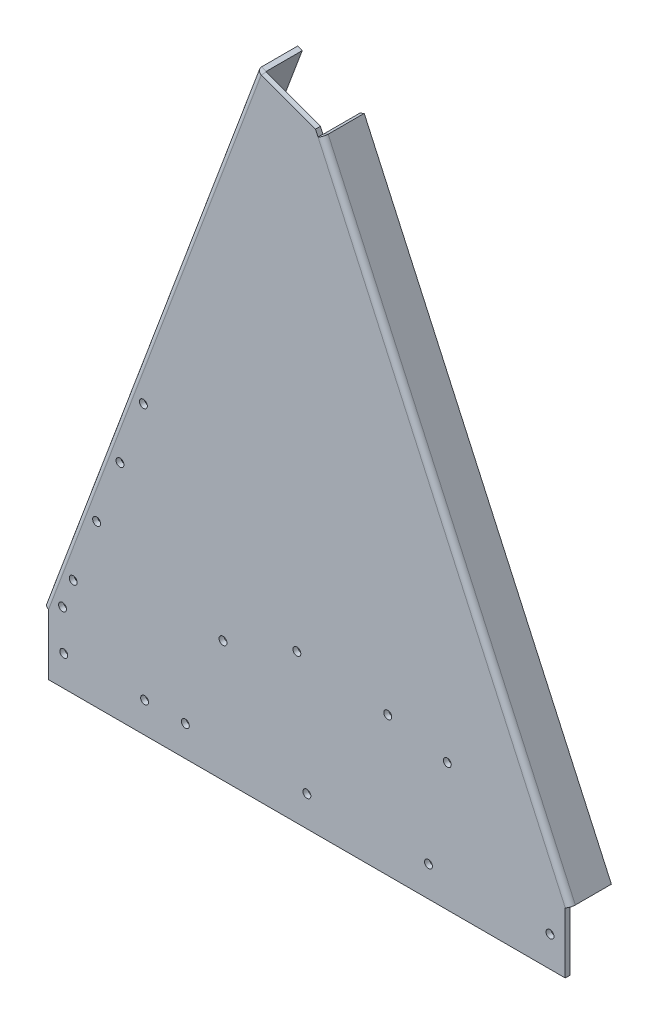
ISO-10303-21;
HEADER;
FILE_DESCRIPTION(('STEP AP214'),'2;1');
FILE_NAME('part.step','',(''),(''),'','','');
FILE_SCHEMA(('AUTOMOTIVE_DESIGN { 1 0 10303 214 1 1 1 1 }'));
ENDSEC;
DATA;
#1=APPLICATION_CONTEXT('core data for automotive mechanical design processes');
#2=APPLICATION_PROTOCOL_DEFINITION('international standard','automotive_design',2000,#1);
#3=PRODUCT_CONTEXT('',#1,'mechanical');
#4=PRODUCT('Part','Part','',(#3));
#5=PRODUCT_RELATED_PRODUCT_CATEGORY('part','',(#4));
#6=PRODUCT_DEFINITION_FORMATION('','',#4);
#7=PRODUCT_DEFINITION_CONTEXT('part definition',#1,'design');
#8=PRODUCT_DEFINITION('design','',#6,#7);
#9=PRODUCT_DEFINITION_SHAPE('','',#8);
#10=(LENGTH_UNIT() NAMED_UNIT(*) SI_UNIT(.MILLI.,.METRE.));
#11=(NAMED_UNIT(*) PLANE_ANGLE_UNIT() SI_UNIT($,.RADIAN.));
#12=(NAMED_UNIT(*) SI_UNIT($,.STERADIAN.) SOLID_ANGLE_UNIT());
#13=UNCERTAINTY_MEASURE_WITH_UNIT(LENGTH_MEASURE(1.E-05),#10,'distance_accuracy_value','');
#14=(GEOMETRIC_REPRESENTATION_CONTEXT(3) GLOBAL_UNCERTAINTY_ASSIGNED_CONTEXT((#13)) GLOBAL_UNIT_ASSIGNED_CONTEXT((#10,
#11,#12)) REPRESENTATION_CONTEXT('',''));
#15=CARTESIAN_POINT('',(0.,0.,0.));
#16=DIRECTION('',(0.,0.,1.));
#17=DIRECTION('',(1.,0.,0.));
#18=AXIS2_PLACEMENT_3D('',#15,#16,#17);
#19=CARTESIAN_POINT('',(425.,100.,8.));
#20=DIRECTION('',(-0.91041077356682,-0.413705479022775,0.));
#21=DIRECTION('',(0.413705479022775,-0.91041077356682,0.));
#22=AXIS2_PLACEMENT_3D('',#19,#20,#21);
#23=PLANE('',#22);
#24=DIRECTION('',(-6.17962856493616E-12,-2.86373031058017E-12,1.));
#25=VECTOR('',#24,1.);
#26=CARTESIAN_POINT('',(18.3275141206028,994.93379041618,5.23875647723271E-12));
#27=LINE('',#26,#25);
#28=CARTESIAN_POINT('',(18.3275141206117,994.933790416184,0.));
#29=VERTEX_POINT('',#28);
#30=CARTESIAN_POINT('',(18.3275141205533,994.933790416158,8.00000000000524));
#31=VERTEX_POINT('',#30);
#32=EDGE_CURVE('E100',#29,#31,#27,.T.);
#33=ORIENTED_EDGE('',*,*,#32,.F.);
#34=DIRECTION('',(-0.413705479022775,0.91041077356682,0.));
#35=VECTOR('',#34,1.);
#36=CARTESIAN_POINT('',(425.,100.,0.));
#37=LINE('',#36,#35);
#38=CARTESIAN_POINT('',(14.1904593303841,1004.03789815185,0.));
#39=VERTEX_POINT('',#38);
#40=EDGE_CURVE('E421',#29,#39,#37,.T.);
#41=ORIENTED_EDGE('',*,*,#40,.T.);
#42=DIRECTION('',(0.,0.,-1.));
#43=VECTOR('',#42,1.);
#44=CARTESIAN_POINT('',(14.1904593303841,1004.03789815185,8.));
#45=LINE('',#44,#43);
#46=CARTESIAN_POINT('',(14.1904593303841,1004.03789815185,8.));
#47=VERTEX_POINT('',#46);
#48=EDGE_CURVE('E449',#47,#39,#45,.T.);
#49=ORIENTED_EDGE('',*,*,#48,.F.);
#50=DIRECTION('',(-0.413705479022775,0.91041077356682,0.));
#51=VECTOR('',#50,1.);
#52=CARTESIAN_POINT('',(425.,100.,8.));
#53=LINE('',#52,#51);
#54=EDGE_CURVE('E432',#31,#47,#53,.T.);
#55=ORIENTED_EDGE('',*,*,#54,.F.);
#56=EDGE_LOOP('',(#33,#41,#49,#55));
#57=FACE_BOUND('',#56,.T.);
#58=ADVANCED_FACE('F83',(#57),#23,.F.);
#59=CARTESIAN_POINT('',(-425.,100.,8.));
#60=DIRECTION('',(1.,0.,0.));
#61=DIRECTION('',(0.,1.,0.));
#62=AXIS2_PLACEMENT_3D('',#59,#60,#61);
#63=PLANE('',#62);
#64=DIRECTION('',(0.,-1.,0.));
#65=VECTOR('',#64,1.);
#66=CARTESIAN_POINT('',(-425.,100.,0.));
#67=LINE('',#66,#65);
#68=CARTESIAN_POINT('',(-425.00000000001,100.000000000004,-5.2804982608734E-12));
#69=VERTEX_POINT('',#68);
#70=CARTESIAN_POINT('',(-425.,0.,0.));
#71=VERTEX_POINT('',#70);
#72=EDGE_CURVE('E414',#69,#71,#67,.T.);
#73=ORIENTED_EDGE('',*,*,#72,.T.);
#74=DIRECTION('',(0.,0.,-1.));
#75=VECTOR('',#74,1.);
#76=CARTESIAN_POINT('',(-425.,0.,8.));
#77=LINE('',#76,#75);
#78=CARTESIAN_POINT('',(-425.,0.,8.));
#79=VERTEX_POINT('',#78);
#80=EDGE_CURVE('E13',#79,#71,#77,.T.);
#81=ORIENTED_EDGE('',*,*,#80,.F.);
#82=DIRECTION('',(0.,-1.,0.));
#83=VECTOR('',#82,1.);
#84=CARTESIAN_POINT('',(-425.,100.,8.));
#85=LINE('',#84,#83);
#86=CARTESIAN_POINT('',(-425.,100.,8.));
#87=VERTEX_POINT('',#86);
#88=EDGE_CURVE('E460',#87,#79,#85,.T.);
#89=ORIENTED_EDGE('',*,*,#88,.F.);
#90=DIRECTION('',(0.,0.,-1.));
#91=VECTOR('',#90,1.);
#92=CARTESIAN_POINT('',(-425.,100.,8.));
#93=LINE('',#92,#91);
#94=EDGE_CURVE('E444',#87,#69,#93,.T.);
#95=ORIENTED_EDGE('',*,*,#94,.T.);
#96=EDGE_LOOP('',(#73,#81,#89,#95));
#97=FACE_BOUND('',#96,.T.);
#98=ADVANCED_FACE('F85',(#97),#63,.F.);
#99=CARTESIAN_POINT('',(-425.,0.,8.));
#100=DIRECTION('',(0.,1.,0.));
#101=DIRECTION('',(-1.,0.,0.));
#102=AXIS2_PLACEMENT_3D('',#99,#100,#101);
#103=PLANE('',#102);
#104=DIRECTION('',(1.,0.,0.));
#105=VECTOR('',#104,1.);
#106=CARTESIAN_POINT('',(-425.,0.,0.));
#107=LINE('',#106,#105);
#108=CARTESIAN_POINT('',(425.,0.,0.));
#109=VERTEX_POINT('',#108);
#110=EDGE_CURVE('E405',#71,#109,#107,.T.);
#111=ORIENTED_EDGE('',*,*,#110,.T.);
#112=DIRECTION('',(0.,0.,-1.));
#113=VECTOR('',#112,1.);
#114=CARTESIAN_POINT('',(425.,0.,8.));
#115=LINE('',#114,#113);
#116=CARTESIAN_POINT('',(425.,0.,8.));
#117=VERTEX_POINT('',#116);
#118=EDGE_CURVE('E92',#117,#109,#115,.T.);
#119=ORIENTED_EDGE('',*,*,#118,.F.);
#120=DIRECTION('',(1.,0.,0.));
#121=VECTOR('',#120,1.);
#122=CARTESIAN_POINT('',(-425.,0.,8.));
#123=LINE('',#122,#121);
#124=EDGE_CURVE('E466',#79,#117,#123,.T.);
#125=ORIENTED_EDGE('',*,*,#124,.F.);
#126=ORIENTED_EDGE('',*,*,#80,.T.);
#127=EDGE_LOOP('',(#111,#119,#125,#126));
#128=FACE_BOUND('',#127,.T.);
#129=ADVANCED_FACE('F392',(#128),#103,.F.);
#130=CARTESIAN_POINT('',(425.,0.,8.));
#131=DIRECTION('',(-1.,0.,0.));
#132=DIRECTION('',(0.,0.,1.));
#133=AXIS2_PLACEMENT_3D('',#130,#131,#132);
#134=PLANE('',#133);
#135=DIRECTION('',(0.,1.,0.));
#136=VECTOR('',#135,1.);
#137=CARTESIAN_POINT('',(425.,0.,0.));
#138=LINE('',#137,#136);
#139=CARTESIAN_POINT('',(425.,100.,0.));
#140=VERTEX_POINT('',#139);
#141=EDGE_CURVE('E413',#109,#140,#138,.T.);
#142=ORIENTED_EDGE('',*,*,#141,.T.);
#143=DIRECTION('',(0.,0.,-1.));
#144=VECTOR('',#143,1.);
#145=CARTESIAN_POINT('',(425.,100.,8.));
#146=LINE('',#145,#144);
#147=CARTESIAN_POINT('',(425.,100.,8.));
#148=VERTEX_POINT('',#147);
#149=EDGE_CURVE('E418',#148,#140,#146,.T.);
#150=ORIENTED_EDGE('',*,*,#149,.F.);
#151=DIRECTION('',(0.,1.,0.));
#152=VECTOR('',#151,1.);
#153=CARTESIAN_POINT('',(425.,0.,8.));
#154=LINE('',#153,#152);
#155=EDGE_CURVE('E417',#117,#148,#154,.T.);
#156=ORIENTED_EDGE('',*,*,#155,.F.);
#157=ORIENTED_EDGE('',*,*,#118,.T.);
#158=EDGE_LOOP('',(#142,#150,#156,#157));
#159=FACE_BOUND('',#158,.T.);
#160=ADVANCED_FACE('F398',(#159),#134,.F.);
#161=CARTESIAN_POINT('',(14.1904593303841,1004.03789815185,8.));
#162=DIRECTION('',(-0.344334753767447,-0.938846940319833,0.));
#163=DIRECTION('',(0.938846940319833,-0.344334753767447,0.));
#164=AXIS2_PLACEMENT_3D('',#161,#162,#163);
#165=PLANE('',#164);
#166=DIRECTION('',(-0.938846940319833,0.344334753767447,0.));
#167=VECTOR('',#166,1.);
#168=CARTESIAN_POINT('',(14.1904593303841,1004.03789815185,0.));
#169=LINE('',#168,#167);
#170=CARTESIAN_POINT('',(-75.0000000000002,1036.74969975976,-5.2804982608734E-12));
#171=VERTEX_POINT('',#170);
#172=EDGE_CURVE('E428',#39,#171,#169,.T.);
#173=ORIENTED_EDGE('',*,*,#172,.T.);
#174=DIRECTION('',(0.,0.,-1.));
#175=VECTOR('',#174,1.);
#176=CARTESIAN_POINT('',(-75.0000000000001,1036.74969975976,8.));
#177=LINE('',#176,#175);
#178=CARTESIAN_POINT('',(-75.0000000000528,1036.74969975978,7.99999999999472));
#179=VERTEX_POINT('',#178);
#180=EDGE_CURVE('E447',#179,#171,#177,.T.);
#181=ORIENTED_EDGE('',*,*,#180,.F.);
#182=DIRECTION('',(-0.938846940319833,0.344334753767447,0.));
#183=VECTOR('',#182,1.);
#184=CARTESIAN_POINT('',(14.1904593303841,1004.03789815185,8.));
#185=LINE('',#184,#183);
#186=EDGE_CURVE('E437',#47,#179,#185,.T.);
#187=ORIENTED_EDGE('',*,*,#186,.F.);
#188=ORIENTED_EDGE('',*,*,#48,.T.);
#189=EDGE_LOOP('',(#173,#181,#187,#188));
#190=FACE_BOUND('',#189,.T.);
#191=ADVANCED_FACE('F396',(#190),#165,.F.);
#192=CARTESIAN_POINT('',(-425.,0.,8.));
#193=DIRECTION('',(0.,0.,1.));
#194=DIRECTION('',(1.,0.,0.));
#195=AXIS2_PLACEMENT_3D('',#192,#193,#194);
#196=PLANE('',#195);
#197=CARTESIAN_POINT('',(-401.973272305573,115.162515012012,8.));
#198=DIRECTION('',(0.,0.,1.));
#199=DIRECTION('',(1.,0.,0.));
#200=AXIS2_PLACEMENT_3D('',#197,#198,#199);
#201=CIRCLE('',#200,6.50000000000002);
#202=CARTESIAN_POINT('',(-395.473272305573,115.162515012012,8.));
#203=VERTEX_POINT('',#202);
#204=EDGE_CURVE('E326',#203,#203,#201,.T.);
#205=ORIENTED_EDGE('',*,*,#204,.F.);
#206=EDGE_LOOP('',(#205));
#207=FACE_BOUND('',#206,.T.);
#208=CARTESIAN_POINT('',(231.,210.,8.));
#209=DIRECTION('',(0.,0.,1.));
#210=DIRECTION('',(1.,0.,0.));
#211=AXIS2_PLACEMENT_3D('',#208,#209,#210);
#212=CIRCLE('',#211,6.50000000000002);
#213=CARTESIAN_POINT('',(237.5,210.,8.));
#214=VERTEX_POINT('',#213);
#215=EDGE_CURVE('E316',#214,#214,#212,.T.);
#216=ORIENTED_EDGE('',*,*,#215,.F.);
#217=EDGE_LOOP('',(#216));
#218=FACE_BOUND('',#217,.T.);
#219=CARTESIAN_POINT('',(133.,229.,8.));
#220=DIRECTION('',(0.,0.,1.));
#221=DIRECTION('',(1.,0.,0.));
#222=AXIS2_PLACEMENT_3D('',#219,#220,#221);
#223=CIRCLE('',#222,6.50000000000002);
#224=CARTESIAN_POINT('',(139.5,229.,8.));
#225=VERTEX_POINT('',#224);
#226=EDGE_CURVE('E313',#225,#225,#223,.T.);
#227=ORIENTED_EDGE('',*,*,#226,.F.);
#228=EDGE_LOOP('',(#227));
#229=FACE_BOUND('',#228,.T.);
#230=CARTESIAN_POINT('',(-16.4999999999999,244.5,8.));
#231=DIRECTION('',(0.,0.,1.));
#232=DIRECTION('',(1.,0.,0.));
#233=AXIS2_PLACEMENT_3D('',#230,#231,#232);
#234=CIRCLE('',#233,6.50000000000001);
#235=CARTESIAN_POINT('',(-9.99999999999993,244.5,8.));
#236=VERTEX_POINT('',#235);
#237=EDGE_CURVE('E310',#236,#236,#234,.T.);
#238=ORIENTED_EDGE('',*,*,#237,.F.);
#239=EDGE_LOOP('',(#238));
#240=FACE_BOUND('',#239,.T.);
#241=CARTESIAN_POINT('',(-138.,199.,8.));
#242=DIRECTION('',(0.,0.,1.));
#243=DIRECTION('',(1.,0.,0.));
#244=AXIS2_PLACEMENT_3D('',#241,#242,#243);
#245=CIRCLE('',#244,6.50000000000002);
#246=CARTESIAN_POINT('',(-131.5,199.,8.));
#247=VERTEX_POINT('',#246);
#248=EDGE_CURVE('E306',#247,#247,#245,.T.);
#249=ORIENTED_EDGE('',*,*,#248,.F.);
#250=EDGE_LOOP('',(#249));
#251=FACE_BOUND('',#250,.T.);
#252=CARTESIAN_POINT('',(-268.973272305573,471.127400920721,8.));
#253=DIRECTION('',(0.,0.,1.));
#254=DIRECTION('',(1.,0.,0.));
#255=AXIS2_PLACEMENT_3D('',#252,#253,#254);
#256=CIRCLE('',#255,6.50000000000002);
#257=CARTESIAN_POINT('',(-262.473272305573,471.127400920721,8.));
#258=VERTEX_POINT('',#257);
#259=EDGE_CURVE('E302',#258,#258,#256,.T.);
#260=ORIENTED_EDGE('',*,*,#259,.F.);
#261=EDGE_LOOP('',(#260));
#262=FACE_BOUND('',#261,.T.);
#263=CARTESIAN_POINT('',(-307.473272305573,368.084933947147,8.));
#264=DIRECTION('',(0.,0.,1.));
#265=DIRECTION('',(1.,0.,0.));
#266=AXIS2_PLACEMENT_3D('',#263,#264,#265);
#267=CIRCLE('',#266,6.50000000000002);
#268=CARTESIAN_POINT('',(-300.973272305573,368.084933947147,8.));
#269=VERTEX_POINT('',#268);
#270=EDGE_CURVE('E298',#269,#269,#267,.T.);
#271=ORIENTED_EDGE('',*,*,#270,.F.);
#272=EDGE_LOOP('',(#271));
#273=FACE_BOUND('',#272,.T.);
#274=CARTESIAN_POINT('',(-345.973272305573,265.042466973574,8.));
#275=DIRECTION('',(0.,0.,1.));
#276=DIRECTION('',(1.,0.,0.));
#277=AXIS2_PLACEMENT_3D('',#274,#275,#276);
#278=CIRCLE('',#277,6.50000000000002);
#279=CARTESIAN_POINT('',(-339.473272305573,265.042466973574,8.));
#280=VERTEX_POINT('',#279);
#281=EDGE_CURVE('E294',#280,#280,#278,.T.);
#282=ORIENTED_EDGE('',*,*,#281,.F.);
#283=EDGE_LOOP('',(#282));
#284=FACE_BOUND('',#283,.T.);
#285=CARTESIAN_POINT('',(-384.473272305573,162.,8.));
#286=DIRECTION('',(0.,0.,1.));
#287=DIRECTION('',(1.,0.,0.));
#288=AXIS2_PLACEMENT_3D('',#285,#286,#287);
#289=CIRCLE('',#288,6.50000000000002);
#290=CARTESIAN_POINT('',(-377.973272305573,162.,8.));
#291=VERTEX_POINT('',#290);
#292=EDGE_CURVE('E290',#291,#291,#289,.T.);
#293=ORIENTED_EDGE('',*,*,#292,.F.);
#294=EDGE_LOOP('',(#293));
#295=FACE_BOUND('',#294,.T.);
#296=CARTESIAN_POINT('',(400.,50.,8.));
#297=DIRECTION('',(0.,0.,1.));
#298=DIRECTION('',(1.,0.,0.));
#299=AXIS2_PLACEMENT_3D('',#296,#297,#298);
#300=CIRCLE('',#299,6.50000000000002);
#301=CARTESIAN_POINT('',(406.5,50.,8.));
#302=VERTEX_POINT('',#301);
#303=EDGE_CURVE('E286',#302,#302,#300,.T.);
#304=ORIENTED_EDGE('',*,*,#303,.F.);
#305=EDGE_LOOP('',(#304));
#306=FACE_BOUND('',#305,.T.);
#307=CARTESIAN_POINT('',(-267.,50.,8.));
#308=DIRECTION('',(0.,0.,1.));
#309=DIRECTION('',(1.,0.,0.));
#310=AXIS2_PLACEMENT_3D('',#307,#308,#309);
#311=CIRCLE('',#310,6.50000000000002);
#312=CARTESIAN_POINT('',(-260.5,50.,8.));
#313=VERTEX_POINT('',#312);
#314=EDGE_CURVE('E282',#313,#313,#311,.T.);
#315=ORIENTED_EDGE('',*,*,#314,.F.);
#316=EDGE_LOOP('',(#315));
#317=FACE_BOUND('',#316,.T.);
#318=CARTESIAN_POINT('',(200.,50.,8.));
#319=DIRECTION('',(0.,0.,1.));
#320=DIRECTION('',(1.,0.,0.));
#321=AXIS2_PLACEMENT_3D('',#318,#319,#320);
#322=CIRCLE('',#321,6.50000000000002);
#323=CARTESIAN_POINT('',(206.5,50.,8.));
#324=VERTEX_POINT('',#323);
#325=EDGE_CURVE('E278',#324,#324,#322,.T.);
#326=ORIENTED_EDGE('',*,*,#325,.F.);
#327=EDGE_LOOP('',(#326));
#328=FACE_BOUND('',#327,.T.);
#329=CARTESIAN_POINT('',(0.,50.,8.));
#330=DIRECTION('',(0.,0.,1.));
#331=DIRECTION('',(1.,0.,0.));
#332=AXIS2_PLACEMENT_3D('',#329,#330,#331);
#333=CIRCLE('',#332,6.5);
#334=CARTESIAN_POINT('',(6.5,50.,8.));
#335=VERTEX_POINT('',#334);
#336=EDGE_CURVE('E274',#335,#335,#333,.T.);
#337=ORIENTED_EDGE('',*,*,#336,.F.);
#338=EDGE_LOOP('',(#337));
#339=FACE_BOUND('',#338,.T.);
#340=CARTESIAN_POINT('',(-200.,50.,8.));
#341=DIRECTION('',(0.,0.,1.));
#342=DIRECTION('',(1.,0.,0.));
#343=AXIS2_PLACEMENT_3D('',#340,#341,#342);
#344=CIRCLE('',#343,6.50000000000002);
#345=CARTESIAN_POINT('',(-193.5,50.,8.));
#346=VERTEX_POINT('',#345);
#347=EDGE_CURVE('E270',#346,#346,#344,.T.);
#348=ORIENTED_EDGE('',*,*,#347,.F.);
#349=EDGE_LOOP('',(#348));
#350=FACE_BOUND('',#349,.T.);
#351=CARTESIAN_POINT('',(-400.,50.,8.));
#352=DIRECTION('',(0.,0.,1.));
#353=DIRECTION('',(1.,0.,0.));
#354=AXIS2_PLACEMENT_3D('',#351,#352,#353);
#355=CIRCLE('',#354,6.50000000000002);
#356=CARTESIAN_POINT('',(-393.5,50.,8.));
#357=VERTEX_POINT('',#356);
#358=EDGE_CURVE('E266',#357,#357,#355,.T.);
#359=ORIENTED_EDGE('',*,*,#358,.F.);
#360=EDGE_LOOP('',(#359));
#361=FACE_BOUND('',#360,.T.);
#362=ORIENTED_EDGE('',*,*,#88,.T.);
#363=ORIENTED_EDGE('',*,*,#124,.T.);
#364=ORIENTED_EDGE('',*,*,#155,.T.);
#365=EDGE_CURVE('E200',#148,#31,#53,.T.);
#366=ORIENTED_EDGE('',*,*,#365,.T.);
#367=ORIENTED_EDGE('',*,*,#54,.T.);
#368=ORIENTED_EDGE('',*,*,#186,.T.);
#369=DIRECTION('',(-0.35,-0.93674969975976,0.));
#370=VECTOR('',#369,1.);
#371=CARTESIAN_POINT('',(-75.0000000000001,1036.74969975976,8.));
#372=LINE('',#371,#370);
#373=EDGE_CURVE('E441',#179,#87,#372,.T.);
#374=ORIENTED_EDGE('',*,*,#373,.T.);
#375=EDGE_LOOP('',(#362,#363,#364,#366,#367,#368,#374));
#376=FACE_BOUND('',#375,.T.);
#377=ADVANCED_FACE('F469',(#207,#218,#229,#240,#251,#262,#273,#284,#295,#306,#317,#328,#339,
#350,#361,#376),#196,.T.);
#378=CARTESIAN_POINT('',(-425.,0.,0.));
#379=DIRECTION('',(0.,0.,1.));
#380=DIRECTION('',(1.,0.,0.));
#381=AXIS2_PLACEMENT_3D('',#378,#379,#380);
#382=PLANE('',#381);
#383=CARTESIAN_POINT('',(-401.973272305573,115.162515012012,0.));
#384=DIRECTION('',(0.,0.,1.));
#385=DIRECTION('',(1.,0.,0.));
#386=AXIS2_PLACEMENT_3D('',#383,#384,#385);
#387=CIRCLE('',#386,6.50000000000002);
#388=CARTESIAN_POINT('',(-395.473272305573,115.162515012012,0.));
#389=VERTEX_POINT('',#388);
#390=EDGE_CURVE('E87',#389,#389,#387,.T.);
#391=ORIENTED_EDGE('',*,*,#390,.T.);
#392=EDGE_LOOP('',(#391));
#393=FACE_BOUND('',#392,.T.);
#394=CARTESIAN_POINT('',(231.,210.,0.));
#395=DIRECTION('',(0.,0.,1.));
#396=DIRECTION('',(1.,0.,0.));
#397=AXIS2_PLACEMENT_3D('',#394,#395,#396);
#398=CIRCLE('',#397,6.50000000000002);
#399=CARTESIAN_POINT('',(237.5,210.,0.));
#400=VERTEX_POINT('',#399);
#401=EDGE_CURVE('E314',#400,#400,#398,.T.);
#402=ORIENTED_EDGE('',*,*,#401,.T.);
#403=EDGE_LOOP('',(#402));
#404=FACE_BOUND('',#403,.T.);
#405=CARTESIAN_POINT('',(133.,229.,0.));
#406=DIRECTION('',(0.,0.,1.));
#407=DIRECTION('',(1.,0.,0.));
#408=AXIS2_PLACEMENT_3D('',#405,#406,#407);
#409=CIRCLE('',#408,6.50000000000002);
#410=CARTESIAN_POINT('',(139.5,229.,0.));
#411=VERTEX_POINT('',#410);
#412=EDGE_CURVE('E311',#411,#411,#409,.T.);
#413=ORIENTED_EDGE('',*,*,#412,.T.);
#414=EDGE_LOOP('',(#413));
#415=FACE_BOUND('',#414,.T.);
#416=CARTESIAN_POINT('',(-16.4999999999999,244.5,0.));
#417=DIRECTION('',(0.,0.,1.));
#418=DIRECTION('',(1.,0.,0.));
#419=AXIS2_PLACEMENT_3D('',#416,#417,#418);
#420=CIRCLE('',#419,6.50000000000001);
#421=CARTESIAN_POINT('',(-9.99999999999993,244.5,0.));
#422=VERTEX_POINT('',#421);
#423=EDGE_CURVE('E307',#422,#422,#420,.T.);
#424=ORIENTED_EDGE('',*,*,#423,.T.);
#425=EDGE_LOOP('',(#424));
#426=FACE_BOUND('',#425,.T.);
#427=CARTESIAN_POINT('',(-138.,199.,0.));
#428=DIRECTION('',(0.,0.,1.));
#429=DIRECTION('',(1.,0.,0.));
#430=AXIS2_PLACEMENT_3D('',#427,#428,#429);
#431=CIRCLE('',#430,6.50000000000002);
#432=CARTESIAN_POINT('',(-131.5,199.,0.));
#433=VERTEX_POINT('',#432);
#434=EDGE_CURVE('E303',#433,#433,#431,.T.);
#435=ORIENTED_EDGE('',*,*,#434,.T.);
#436=EDGE_LOOP('',(#435));
#437=FACE_BOUND('',#436,.T.);
#438=CARTESIAN_POINT('',(-268.973272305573,471.127400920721,0.));
#439=DIRECTION('',(0.,0.,1.));
#440=DIRECTION('',(1.,0.,0.));
#441=AXIS2_PLACEMENT_3D('',#438,#439,#440);
#442=CIRCLE('',#441,6.50000000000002);
#443=CARTESIAN_POINT('',(-262.473272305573,471.127400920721,0.));
#444=VERTEX_POINT('',#443);
#445=EDGE_CURVE('E299',#444,#444,#442,.T.);
#446=ORIENTED_EDGE('',*,*,#445,.T.);
#447=EDGE_LOOP('',(#446));
#448=FACE_BOUND('',#447,.T.);
#449=CARTESIAN_POINT('',(-307.473272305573,368.084933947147,0.));
#450=DIRECTION('',(0.,0.,1.));
#451=DIRECTION('',(1.,0.,0.));
#452=AXIS2_PLACEMENT_3D('',#449,#450,#451);
#453=CIRCLE('',#452,6.50000000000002);
#454=CARTESIAN_POINT('',(-300.973272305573,368.084933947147,0.));
#455=VERTEX_POINT('',#454);
#456=EDGE_CURVE('E295',#455,#455,#453,.T.);
#457=ORIENTED_EDGE('',*,*,#456,.T.);
#458=EDGE_LOOP('',(#457));
#459=FACE_BOUND('',#458,.T.);
#460=CARTESIAN_POINT('',(-345.973272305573,265.042466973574,0.));
#461=DIRECTION('',(0.,0.,1.));
#462=DIRECTION('',(1.,0.,0.));
#463=AXIS2_PLACEMENT_3D('',#460,#461,#462);
#464=CIRCLE('',#463,6.50000000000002);
#465=CARTESIAN_POINT('',(-339.473272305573,265.042466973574,0.));
#466=VERTEX_POINT('',#465);
#467=EDGE_CURVE('E291',#466,#466,#464,.T.);
#468=ORIENTED_EDGE('',*,*,#467,.T.);
#469=EDGE_LOOP('',(#468));
#470=FACE_BOUND('',#469,.T.);
#471=CARTESIAN_POINT('',(-384.473272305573,162.,0.));
#472=DIRECTION('',(0.,0.,1.));
#473=DIRECTION('',(1.,0.,0.));
#474=AXIS2_PLACEMENT_3D('',#471,#472,#473);
#475=CIRCLE('',#474,6.50000000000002);
#476=CARTESIAN_POINT('',(-377.973272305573,162.,0.));
#477=VERTEX_POINT('',#476);
#478=EDGE_CURVE('E287',#477,#477,#475,.T.);
#479=ORIENTED_EDGE('',*,*,#478,.T.);
#480=EDGE_LOOP('',(#479));
#481=FACE_BOUND('',#480,.T.);
#482=CARTESIAN_POINT('',(400.,50.,0.));
#483=DIRECTION('',(0.,0.,1.));
#484=DIRECTION('',(1.,0.,0.));
#485=AXIS2_PLACEMENT_3D('',#482,#483,#484);
#486=CIRCLE('',#485,6.50000000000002);
#487=CARTESIAN_POINT('',(406.5,50.,0.));
#488=VERTEX_POINT('',#487);
#489=EDGE_CURVE('E283',#488,#488,#486,.T.);
#490=ORIENTED_EDGE('',*,*,#489,.T.);
#491=EDGE_LOOP('',(#490));
#492=FACE_BOUND('',#491,.T.);
#493=CARTESIAN_POINT('',(-267.,50.,0.));
#494=DIRECTION('',(0.,0.,1.));
#495=DIRECTION('',(1.,0.,0.));
#496=AXIS2_PLACEMENT_3D('',#493,#494,#495);
#497=CIRCLE('',#496,6.50000000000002);
#498=CARTESIAN_POINT('',(-260.5,50.,0.));
#499=VERTEX_POINT('',#498);
#500=EDGE_CURVE('E279',#499,#499,#497,.T.);
#501=ORIENTED_EDGE('',*,*,#500,.T.);
#502=EDGE_LOOP('',(#501));
#503=FACE_BOUND('',#502,.T.);
#504=CARTESIAN_POINT('',(200.,50.,0.));
#505=DIRECTION('',(0.,0.,1.));
#506=DIRECTION('',(1.,0.,0.));
#507=AXIS2_PLACEMENT_3D('',#504,#505,#506);
#508=CIRCLE('',#507,6.50000000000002);
#509=CARTESIAN_POINT('',(206.5,50.,0.));
#510=VERTEX_POINT('',#509);
#511=EDGE_CURVE('E275',#510,#510,#508,.T.);
#512=ORIENTED_EDGE('',*,*,#511,.T.);
#513=EDGE_LOOP('',(#512));
#514=FACE_BOUND('',#513,.T.);
#515=CARTESIAN_POINT('',(0.,50.,0.));
#516=DIRECTION('',(0.,0.,1.));
#517=DIRECTION('',(1.,0.,0.));
#518=AXIS2_PLACEMENT_3D('',#515,#516,#517);
#519=CIRCLE('',#518,6.5);
#520=CARTESIAN_POINT('',(6.5,50.,0.));
#521=VERTEX_POINT('',#520);
#522=EDGE_CURVE('E271',#521,#521,#519,.T.);
#523=ORIENTED_EDGE('',*,*,#522,.T.);
#524=EDGE_LOOP('',(#523));
#525=FACE_BOUND('',#524,.T.);
#526=CARTESIAN_POINT('',(-200.,50.,0.));
#527=DIRECTION('',(0.,0.,1.));
#528=DIRECTION('',(1.,0.,0.));
#529=AXIS2_PLACEMENT_3D('',#526,#527,#528);
#530=CIRCLE('',#529,6.50000000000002);
#531=CARTESIAN_POINT('',(-193.5,50.,0.));
#532=VERTEX_POINT('',#531);
#533=EDGE_CURVE('E267',#532,#532,#530,.T.);
#534=ORIENTED_EDGE('',*,*,#533,.T.);
#535=EDGE_LOOP('',(#534));
#536=FACE_BOUND('',#535,.T.);
#537=CARTESIAN_POINT('',(-400.,50.,0.));
#538=DIRECTION('',(0.,0.,1.));
#539=DIRECTION('',(1.,0.,0.));
#540=AXIS2_PLACEMENT_3D('',#537,#538,#539);
#541=CIRCLE('',#540,6.50000000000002);
#542=CARTESIAN_POINT('',(-393.5,50.,0.));
#543=VERTEX_POINT('',#542);
#544=EDGE_CURVE('E245',#543,#543,#541,.T.);
#545=ORIENTED_EDGE('',*,*,#544,.T.);
#546=EDGE_LOOP('',(#545));
#547=FACE_BOUND('',#546,.T.);
#548=ORIENTED_EDGE('',*,*,#72,.F.);
#549=DIRECTION('',(-0.35,-0.93674969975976,0.));
#550=VECTOR('',#549,1.);
#551=CARTESIAN_POINT('',(-75.0000000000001,1036.74969975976,0.));
#552=LINE('',#551,#550);
#553=EDGE_CURVE('E459',#171,#69,#552,.T.);
#554=ORIENTED_EDGE('',*,*,#553,.F.);
#555=ORIENTED_EDGE('',*,*,#172,.F.);
#556=ORIENTED_EDGE('',*,*,#40,.F.);
#557=EDGE_CURVE('E370',#140,#29,#37,.T.);
#558=ORIENTED_EDGE('',*,*,#557,.F.);
#559=ORIENTED_EDGE('',*,*,#141,.F.);
#560=ORIENTED_EDGE('',*,*,#110,.F.);
#561=EDGE_LOOP('',(#548,#554,#555,#556,#558,#559,#560));
#562=FACE_BOUND('',#561,.T.);
#563=ADVANCED_FACE('F420',(#393,#404,#415,#426,#437,#448,#459,#470,#481,#492,#503,#514,#525,
#536,#547,#562),#382,.F.);
#564=CARTESIAN_POINT('',(-425.000000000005,100.000000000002,-0.736600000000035));
#565=DIRECTION('',(-0.35000000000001,-0.936749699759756,0.));
#566=DIRECTION('',(0.936749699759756,-0.35000000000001,0.));
#567=AXIS2_PLACEMENT_3D('',#564,#565,#566);
#568=PLANE('',#567);
#569=DIRECTION('',(0.93674969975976,-0.35,0.));
#570=VECTOR('',#569,1.);
#571=CARTESIAN_POINT('',(-433.184007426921,103.05781,-0.736599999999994));
#572=LINE('',#571,#570);
#573=CARTESIAN_POINT('',(-425.690009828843,100.25781,-0.736600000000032));
#574=VERTEX_POINT('',#573);
#575=CARTESIAN_POINT('',(-433.184007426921,103.05781,-0.736599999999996));
#576=VERTEX_POINT('',#575);
#577=EDGE_CURVE('E254',#574,#576,#572,.F.);
#578=ORIENTED_EDGE('',*,*,#577,.F.);
#579=CARTESIAN_POINT('',(-425.000000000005,100.000000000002,-0.736600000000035));
#580=DIRECTION('',(0.35000000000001,0.936749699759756,0.));
#581=DIRECTION('',(-0.936749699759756,0.35000000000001,0.));
#582=AXIS2_PLACEMENT_3D('',#579,#580,#581);
#583=CIRCLE('',#582,0.736599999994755);
#584=EDGE_CURVE('E482',#69,#574,#583,.F.);
#585=ORIENTED_EDGE('',*,*,#584,.F.);
#586=ORIENTED_EDGE('',*,*,#94,.F.);
#587=CARTESIAN_POINT('',(-425.000000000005,100.000000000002,-0.736600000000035));
#588=DIRECTION('',(0.35000000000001,0.936749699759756,0.));
#589=DIRECTION('',(-0.936749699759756,0.35000000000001,0.));
#590=AXIS2_PLACEMENT_3D('',#587,#588,#589);
#591=CIRCLE('',#590,8.73659999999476);
#592=EDGE_CURVE('E108',#87,#576,#591,.F.);
#593=ORIENTED_EDGE('',*,*,#592,.T.);
#594=EDGE_LOOP('',(#578,#585,#586,#593));
#595=FACE_BOUND('',#594,.T.);
#596=ADVANCED_FACE('F491',(#595),#568,.T.);
#597=CARTESIAN_POINT('',(-74.9999999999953,1036.74969975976,-0.736600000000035));
#598=DIRECTION('',(-0.35000000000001,-0.936749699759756,0.));
#599=DIRECTION('',(0.936749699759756,-0.35000000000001,0.));
#600=AXIS2_PLACEMENT_3D('',#597,#598,#599);
#601=PLANE('',#600);
#602=CARTESIAN_POINT('',(-74.9999999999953,1036.74969975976,-0.736600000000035));
#603=DIRECTION('',(0.35000000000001,0.936749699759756,0.));
#604=DIRECTION('',(-0.936749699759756,0.35000000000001,0.));
#605=AXIS2_PLACEMENT_3D('',#602,#603,#604);
#606=CIRCLE('',#605,0.736599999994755);
#607=CARTESIAN_POINT('',(-75.6900098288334,1037.00750975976,-0.736600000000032));
#608=VERTEX_POINT('',#607);
#609=EDGE_CURVE('E476',#608,#171,#606,.T.);
#610=ORIENTED_EDGE('',*,*,#609,.F.);
#611=DIRECTION('',(0.93674969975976,-0.35,0.));
#612=VECTOR('',#611,1.);
#613=CARTESIAN_POINT('',(-75.6900098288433,1037.00750975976,-0.736600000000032));
#614=LINE('',#613,#612);
#615=CARTESIAN_POINT('',(-83.1840074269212,1039.80750975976,-0.736599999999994));
#616=VERTEX_POINT('',#615);
#617=EDGE_CURVE('E500',#608,#616,#614,.F.);
#618=ORIENTED_EDGE('',*,*,#617,.T.);
#619=CARTESIAN_POINT('',(-74.9999999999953,1036.74969975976,-0.736600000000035));
#620=DIRECTION('',(0.35000000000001,0.936749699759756,0.));
#621=DIRECTION('',(-0.936749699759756,0.35000000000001,0.));
#622=AXIS2_PLACEMENT_3D('',#619,#620,#621);
#623=CIRCLE('',#622,8.73659999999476);
#624=EDGE_CURVE('E478',#616,#179,#623,.T.);
#625=ORIENTED_EDGE('',*,*,#624,.T.);
#626=ORIENTED_EDGE('',*,*,#180,.T.);
#627=EDGE_LOOP('',(#610,#618,#625,#626));
#628=FACE_BOUND('',#627,.T.);
#629=ADVANCED_FACE('F474',(#628),#601,.F.);
#630=CARTESIAN_POINT('',(-74.9999999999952,1036.74969975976,-0.736600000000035));
#631=DIRECTION('',(0.35000000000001,0.936749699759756,0.));
#632=DIRECTION('',(-0.936749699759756,0.35000000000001,0.));
#633=AXIS2_PLACEMENT_3D('',#630,#631,#632);
#634=CYLINDRICAL_SURFACE('',#633,8.73659999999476);
#635=ORIENTED_EDGE('',*,*,#373,.F.);
#636=ORIENTED_EDGE('',*,*,#624,.F.);
#637=DIRECTION('',(0.35,0.93674969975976,0.));
#638=VECTOR('',#637,1.);
#639=CARTESIAN_POINT('',(-433.184007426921,103.05781,-0.736599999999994));
#640=LINE('',#639,#638);
#641=EDGE_CURVE('E517',#616,#576,#640,.F.);
#642=ORIENTED_EDGE('',*,*,#641,.T.);
#643=ORIENTED_EDGE('',*,*,#592,.F.);
#644=EDGE_LOOP('',(#635,#636,#642,#643));
#645=FACE_BOUND('',#644,.T.);
#646=ADVANCED_FACE('F536',(#645),#634,.T.);
#647=CARTESIAN_POINT('',(-74.9999999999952,1036.74969975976,-0.736600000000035));
#648=DIRECTION('',(0.35000000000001,0.936749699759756,0.));
#649=DIRECTION('',(-0.936749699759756,0.35000000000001,0.));
#650=AXIS2_PLACEMENT_3D('',#647,#648,#649);
#651=CYLINDRICAL_SURFACE('',#650,0.736599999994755);
#652=ORIENTED_EDGE('',*,*,#553,.T.);
#653=ORIENTED_EDGE('',*,*,#584,.T.);
#654=DIRECTION('',(0.35,0.93674969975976,0.));
#655=VECTOR('',#654,1.);
#656=CARTESIAN_POINT('',(-425.690009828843,100.25781,-0.736600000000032));
#657=LINE('',#656,#655);
#658=EDGE_CURVE('E481',#574,#608,#657,.T.);
#659=ORIENTED_EDGE('',*,*,#658,.T.);
#660=ORIENTED_EDGE('',*,*,#609,.T.);
#661=EDGE_LOOP('',(#652,#653,#659,#660));
#662=FACE_BOUND('',#661,.T.);
#663=ADVANCED_FACE('F479',(#662),#651,.F.);
#664=CARTESIAN_POINT('',(-83.1840074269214,1039.80750975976,-60.));
#665=DIRECTION('',(-0.35,-0.93674969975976,0.));
#666=DIRECTION('',(0.93674969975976,-0.35,0.));
#667=AXIS2_PLACEMENT_3D('',#664,#665,#666);
#668=PLANE('',#667);
#669=ORIENTED_EDGE('',*,*,#617,.F.);
#670=DIRECTION('',(0.,0.,1.));
#671=VECTOR('',#670,1.);
#672=CARTESIAN_POINT('',(-75.6900098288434,1037.00750975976,-60.));
#673=LINE('',#672,#671);
#674=CARTESIAN_POINT('',(-75.6900098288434,1037.00750975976,-60.));
#675=VERTEX_POINT('',#674);
#676=EDGE_CURVE('E499',#608,#675,#673,.F.);
#677=ORIENTED_EDGE('',*,*,#676,.T.);
#678=DIRECTION('',(0.93674969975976,-0.35,0.));
#679=VECTOR('',#678,1.);
#680=CARTESIAN_POINT('',(-83.1840074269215,1039.80750975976,-60.));
#681=LINE('',#680,#679);
#682=CARTESIAN_POINT('',(-83.1840074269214,1039.80750975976,-60.));
#683=VERTEX_POINT('',#682);
#684=EDGE_CURVE('E249',#683,#675,#681,.T.);
#685=ORIENTED_EDGE('',*,*,#684,.F.);
#686=DIRECTION('',(0.,0.,-1.));
#687=VECTOR('',#686,1.);
#688=CARTESIAN_POINT('',(-83.1840074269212,1039.80750975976,0.));
#689=LINE('',#688,#687);
#690=EDGE_CURVE('E508',#616,#683,#689,.T.);
#691=ORIENTED_EDGE('',*,*,#690,.F.);
#692=EDGE_LOOP('',(#669,#677,#685,#691));
#693=FACE_BOUND('',#692,.T.);
#694=ADVANCED_FACE('F527',(#693),#668,.F.);
#695=CARTESIAN_POINT('',(-433.184007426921,103.05781,0.));
#696=DIRECTION('',(0.35,0.93674969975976,0.));
#697=DIRECTION('',(-0.93674969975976,0.35,0.));
#698=AXIS2_PLACEMENT_3D('',#695,#696,#697);
#699=PLANE('',#698);
#700=ORIENTED_EDGE('',*,*,#577,.T.);
#701=DIRECTION('',(0.,0.,1.));
#702=VECTOR('',#701,1.);
#703=CARTESIAN_POINT('',(-433.184007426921,103.05781,1.10652516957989E-12));
#704=LINE('',#703,#702);
#705=CARTESIAN_POINT('',(-433.184007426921,103.05781,-60.));
#706=VERTEX_POINT('',#705);
#707=EDGE_CURVE('E525',#706,#576,#704,.T.);
#708=ORIENTED_EDGE('',*,*,#707,.F.);
#709=DIRECTION('',(0.93674969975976,-0.35,0.));
#710=VECTOR('',#709,1.);
#711=CARTESIAN_POINT('',(-433.184007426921,103.05781,-60.));
#712=LINE('',#711,#710);
#713=CARTESIAN_POINT('',(-425.690009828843,100.25781,-60.));
#714=VERTEX_POINT('',#713);
#715=EDGE_CURVE('E486',#706,#714,#712,.T.);
#716=ORIENTED_EDGE('',*,*,#715,.T.);
#717=DIRECTION('',(0.,0.,-1.));
#718=VECTOR('',#717,1.);
#719=CARTESIAN_POINT('',(-425.690009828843,100.25781,0.));
#720=LINE('',#719,#718);
#721=EDGE_CURVE('E498',#714,#574,#720,.F.);
#722=ORIENTED_EDGE('',*,*,#721,.T.);
#723=EDGE_LOOP('',(#700,#708,#716,#722));
#724=FACE_BOUND('',#723,.T.);
#725=ADVANCED_FACE('F504',(#724),#699,.F.);
#726=CARTESIAN_POINT('',(-83.1840074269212,1039.80750975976,0.));
#727=DIRECTION('',(0.93674969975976,-0.35,0.));
#728=DIRECTION('',(0.35,0.93674969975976,0.));
#729=AXIS2_PLACEMENT_3D('',#726,#727,#728);
#730=PLANE('',#729);
#731=ORIENTED_EDGE('',*,*,#641,.F.);
#732=ORIENTED_EDGE('',*,*,#690,.T.);
#733=DIRECTION('',(-0.35,-0.93674969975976,0.));
#734=VECTOR('',#733,1.);
#735=CARTESIAN_POINT('',(-83.1840074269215,1039.80750975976,-60.));
#736=LINE('',#735,#734);
#737=EDGE_CURVE('E511',#683,#706,#736,.T.);
#738=ORIENTED_EDGE('',*,*,#737,.T.);
#739=ORIENTED_EDGE('',*,*,#707,.T.);
#740=EDGE_LOOP('',(#731,#732,#738,#739));
#741=FACE_BOUND('',#740,.T.);
#742=ADVANCED_FACE('F523',(#741),#730,.F.);
#743=CARTESIAN_POINT('',(-75.6900098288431,1037.00750975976,0.));
#744=DIRECTION('',(0.93674969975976,-0.35,0.));
#745=DIRECTION('',(0.35,0.93674969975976,0.));
#746=AXIS2_PLACEMENT_3D('',#743,#744,#745);
#747=PLANE('',#746);
#748=ORIENTED_EDGE('',*,*,#676,.F.);
#749=ORIENTED_EDGE('',*,*,#658,.F.);
#750=ORIENTED_EDGE('',*,*,#721,.F.);
#751=DIRECTION('',(0.35,0.93674969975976,0.));
#752=VECTOR('',#751,1.);
#753=CARTESIAN_POINT('',(-425.690009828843,100.25781,-60.));
#754=LINE('',#753,#752);
#755=EDGE_CURVE('E509',#675,#714,#754,.F.);
#756=ORIENTED_EDGE('',*,*,#755,.F.);
#757=EDGE_LOOP('',(#748,#749,#750,#756));
#758=FACE_BOUND('',#757,.T.);
#759=ADVANCED_FACE('F381',(#758),#747,.T.);
#760=CARTESIAN_POINT('',(-433.184007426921,103.05781,-60.));
#761=DIRECTION('',(0.,0.,1.));
#762=DIRECTION('',(1.,0.,0.));
#763=AXIS2_PLACEMENT_3D('',#760,#761,#762);
#764=PLANE('',#763);
#765=ORIENTED_EDGE('',*,*,#755,.T.);
#766=ORIENTED_EDGE('',*,*,#715,.F.);
#767=ORIENTED_EDGE('',*,*,#737,.F.);
#768=ORIENTED_EDGE('',*,*,#684,.T.);
#769=EDGE_LOOP('',(#765,#766,#767,#768));
#770=FACE_BOUND('',#769,.T.);
#771=ADVANCED_FACE('F374',(#770),#764,.F.);
#772=CARTESIAN_POINT('',(18.3275141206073,994.933790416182,-0.736599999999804));
#773=DIRECTION('',(-0.413705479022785,0.910410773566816,0.));
#774=DIRECTION('',(-0.910410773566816,-0.413705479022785,0.));
#775=AXIS2_PLACEMENT_3D('',#772,#773,#774);
#776=PLANE('',#775);
#777=DIRECTION('',(-0.91041077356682,-0.413705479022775,0.));
#778=VECTOR('',#777,1.);
#779=CARTESIAN_POINT('',(26.2814088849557,998.548169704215,-0.736599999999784));
#780=LINE('',#779,#778);
#781=CARTESIAN_POINT('',(18.9981226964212,995.238525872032,-0.736599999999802));
#782=VERTEX_POINT('',#781);
#783=CARTESIAN_POINT('',(26.2814088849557,998.548169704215,-0.736599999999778));
#784=VERTEX_POINT('',#783);
#785=EDGE_CURVE('E242',#782,#784,#780,.F.);
#786=ORIENTED_EDGE('',*,*,#785,.F.);
#787=CARTESIAN_POINT('',(18.3275141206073,994.933790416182,-0.736599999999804));
#788=DIRECTION('',(0.413705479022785,-0.910410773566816,0.));
#789=DIRECTION('',(0.910410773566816,0.413705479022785,0.));
#790=AXIS2_PLACEMENT_3D('',#787,#788,#789);
#791=CIRCLE('',#790,0.736600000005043);
#792=EDGE_CURVE('E204',#29,#782,#791,.F.);
#793=ORIENTED_EDGE('',*,*,#792,.F.);
#794=ORIENTED_EDGE('',*,*,#32,.T.);
#795=CARTESIAN_POINT('',(18.3275141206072,994.933790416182,-0.736599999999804));
#796=DIRECTION('',(0.413705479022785,-0.910410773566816,0.));
#797=DIRECTION('',(0.910410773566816,0.413705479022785,0.));
#798=AXIS2_PLACEMENT_3D('',#795,#796,#797);
#799=CIRCLE('',#798,8.73660000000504);
#800=EDGE_CURVE('E203',#31,#784,#799,.F.);
#801=ORIENTED_EDGE('',*,*,#800,.T.);
#802=EDGE_LOOP('',(#786,#793,#794,#801));
#803=FACE_BOUND('',#802,.T.);
#804=ADVANCED_FACE('F372',(#803),#776,.T.);
#805=CARTESIAN_POINT('',(425.000000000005,100.000000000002,-0.736600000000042));
#806=DIRECTION('',(-0.413705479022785,0.910410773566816,0.));
#807=DIRECTION('',(-0.910410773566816,-0.413705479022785,0.));
#808=AXIS2_PLACEMENT_3D('',#805,#806,#807);
#809=PLANE('',#808);
#810=CARTESIAN_POINT('',(425.000000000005,100.000000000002,-0.736600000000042));
#811=DIRECTION('',(0.413705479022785,-0.910410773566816,0.));
#812=DIRECTION('',(0.910410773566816,0.413705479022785,0.));
#813=AXIS2_PLACEMENT_3D('',#810,#811,#812);
#814=CIRCLE('',#813,0.736600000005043);
#815=CARTESIAN_POINT('',(425.670608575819,100.304735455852,-0.73660000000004));
#816=VERTEX_POINT('',#815);
#817=EDGE_CURVE('E211',#816,#140,#814,.T.);
#818=ORIENTED_EDGE('',*,*,#817,.F.);
#819=DIRECTION('',(-0.91041077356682,-0.413705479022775,0.));
#820=VECTOR('',#819,1.);
#821=CARTESIAN_POINT('',(425.670608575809,100.304735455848,-0.736600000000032));
#822=LINE('',#821,#820);
#823=CARTESIAN_POINT('',(432.953894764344,103.61437928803,-0.736600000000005));
#824=VERTEX_POINT('',#823);
#825=EDGE_CURVE('E208',#816,#824,#822,.F.);
#826=ORIENTED_EDGE('',*,*,#825,.T.);
#827=CARTESIAN_POINT('',(425.000000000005,100.000000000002,-0.736600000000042));
#828=DIRECTION('',(0.413705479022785,-0.910410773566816,0.));
#829=DIRECTION('',(0.910410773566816,0.413705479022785,0.));
#830=AXIS2_PLACEMENT_3D('',#827,#828,#829);
#831=CIRCLE('',#830,8.73660000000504);
#832=EDGE_CURVE('E193',#824,#148,#831,.T.);
#833=ORIENTED_EDGE('',*,*,#832,.T.);
#834=ORIENTED_EDGE('',*,*,#149,.T.);
#835=EDGE_LOOP('',(#818,#826,#833,#834));
#836=FACE_BOUND('',#835,.T.);
#837=ADVANCED_FACE('F209',(#836),#809,.F.);
#838=CARTESIAN_POINT('',(425.000000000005,100.000000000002,-0.736600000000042));
#839=DIRECTION('',(0.413705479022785,-0.910410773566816,0.));
#840=DIRECTION('',(0.910410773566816,0.413705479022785,0.));
#841=AXIS2_PLACEMENT_3D('',#838,#839,#840);
#842=CYLINDRICAL_SURFACE('',#841,8.73660000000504);
#843=ORIENTED_EDGE('',*,*,#365,.F.);
#844=ORIENTED_EDGE('',*,*,#832,.F.);
#845=DIRECTION('',(0.413705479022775,-0.91041077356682,0.));
#846=VECTOR('',#845,1.);
#847=CARTESIAN_POINT('',(432.953894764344,103.61437928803,-0.736600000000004));
#848=LINE('',#847,#846);
#849=EDGE_CURVE('E198',#784,#824,#848,.T.);
#850=ORIENTED_EDGE('',*,*,#849,.F.);
#851=ORIENTED_EDGE('',*,*,#800,.F.);
#852=EDGE_LOOP('',(#843,#844,#850,#851));
#853=FACE_BOUND('',#852,.T.);
#854=ADVANCED_FACE('F195',(#853),#842,.T.);
#855=CARTESIAN_POINT('',(425.000000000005,100.000000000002,-0.736600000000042));
#856=DIRECTION('',(0.413705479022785,-0.910410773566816,0.));
#857=DIRECTION('',(0.910410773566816,0.413705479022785,0.));
#858=AXIS2_PLACEMENT_3D('',#855,#856,#857);
#859=CYLINDRICAL_SURFACE('',#858,0.736600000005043);
#860=ORIENTED_EDGE('',*,*,#557,.T.);
#861=ORIENTED_EDGE('',*,*,#792,.T.);
#862=DIRECTION('',(-0.413705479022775,0.91041077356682,0.));
#863=VECTOR('',#862,1.);
#864=CARTESIAN_POINT('',(18.9981226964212,995.238525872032,-0.73659999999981));
#865=LINE('',#864,#863);
#866=EDGE_CURVE('E215',#782,#816,#865,.F.);
#867=ORIENTED_EDGE('',*,*,#866,.T.);
#868=ORIENTED_EDGE('',*,*,#817,.T.);
#869=EDGE_LOOP('',(#860,#861,#867,#868));
#870=FACE_BOUND('',#869,.T.);
#871=ADVANCED_FACE('F367',(#870),#859,.F.);
#872=CARTESIAN_POINT('',(432.953894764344,103.61437928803,-60.));
#873=DIRECTION('',(-0.413705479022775,0.91041077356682,0.));
#874=DIRECTION('',(-0.91041077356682,-0.413705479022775,0.));
#875=AXIS2_PLACEMENT_3D('',#872,#873,#874);
#876=PLANE('',#875);
#877=ORIENTED_EDGE('',*,*,#825,.F.);
#878=DIRECTION('',(0.,0.,-1.));
#879=VECTOR('',#878,1.);
#880=CARTESIAN_POINT('',(425.67060857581,100.304735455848,-60.));
#881=LINE('',#880,#879);
#882=CARTESIAN_POINT('',(425.67060857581,100.304735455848,-60.));
#883=VERTEX_POINT('',#882);
#884=EDGE_CURVE('E224',#816,#883,#881,.T.);
#885=ORIENTED_EDGE('',*,*,#884,.T.);
#886=DIRECTION('',(-0.91041077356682,-0.413705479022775,0.));
#887=VECTOR('',#886,1.);
#888=CARTESIAN_POINT('',(432.953894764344,103.61437928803,-60.));
#889=LINE('',#888,#887);
#890=CARTESIAN_POINT('',(432.953894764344,103.61437928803,-60.));
#891=VERTEX_POINT('',#890);
#892=EDGE_CURVE('E229',#891,#883,#889,.T.);
#893=ORIENTED_EDGE('',*,*,#892,.F.);
#894=DIRECTION('',(0.,0.,1.));
#895=VECTOR('',#894,1.);
#896=CARTESIAN_POINT('',(432.953894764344,103.61437928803,-60.));
#897=LINE('',#896,#895);
#898=EDGE_CURVE('E220',#824,#891,#897,.F.);
#899=ORIENTED_EDGE('',*,*,#898,.F.);
#900=EDGE_LOOP('',(#877,#885,#893,#899));
#901=FACE_BOUND('',#900,.T.);
#902=ADVANCED_FACE('F227',(#901),#876,.F.);
#903=CARTESIAN_POINT('',(26.2814088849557,998.548169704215,2.08500073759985E-13));
#904=DIRECTION('',(0.413705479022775,-0.91041077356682,0.));
#905=DIRECTION('',(0.91041077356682,0.413705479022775,0.));
#906=AXIS2_PLACEMENT_3D('',#903,#904,#905);
#907=PLANE('',#906);
#908=ORIENTED_EDGE('',*,*,#785,.T.);
#909=DIRECTION('',(0.,0.,-1.));
#910=VECTOR('',#909,1.);
#911=CARTESIAN_POINT('',(26.2814088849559,998.548169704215,-59.9999999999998));
#912=LINE('',#911,#910);
#913=CARTESIAN_POINT('',(26.2814088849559,998.548169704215,-59.9999999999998));
#914=VERTEX_POINT('',#913);
#915=EDGE_CURVE('E223',#914,#784,#912,.F.);
#916=ORIENTED_EDGE('',*,*,#915,.F.);
#917=DIRECTION('',(-0.91041077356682,-0.413705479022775,0.));
#918=VECTOR('',#917,1.);
#919=CARTESIAN_POINT('',(26.2814088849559,998.548169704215,-59.9999999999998));
#920=LINE('',#919,#918);
#921=CARTESIAN_POINT('',(18.9981226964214,995.238525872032,-59.9999999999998));
#922=VERTEX_POINT('',#921);
#923=EDGE_CURVE('E354',#914,#922,#920,.T.);
#924=ORIENTED_EDGE('',*,*,#923,.T.);
#925=DIRECTION('',(0.,0.,1.));
#926=VECTOR('',#925,1.);
#927=CARTESIAN_POINT('',(18.9981226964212,995.238525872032,1.82312009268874E-13));
#928=LINE('',#927,#926);
#929=EDGE_CURVE('E231',#922,#782,#928,.T.);
#930=ORIENTED_EDGE('',*,*,#929,.T.);
#931=EDGE_LOOP('',(#908,#916,#924,#930));
#932=FACE_BOUND('',#931,.T.);
#933=ADVANCED_FACE('F359',(#932),#907,.F.);
#934=CARTESIAN_POINT('',(432.953894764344,103.61437928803,-60.));
#935=DIRECTION('',(0.91041077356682,0.413705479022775,0.));
#936=DIRECTION('',(-0.413705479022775,0.91041077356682,0.));
#937=AXIS2_PLACEMENT_3D('',#934,#935,#936);
#938=PLANE('',#937);
#939=ORIENTED_EDGE('',*,*,#915,.T.);
#940=ORIENTED_EDGE('',*,*,#849,.T.);
#941=ORIENTED_EDGE('',*,*,#898,.T.);
#942=DIRECTION('',(0.413705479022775,-0.91041077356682,0.));
#943=VECTOR('',#942,1.);
#944=CARTESIAN_POINT('',(432.953894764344,103.61437928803,-60.));
#945=LINE('',#944,#943);
#946=EDGE_CURVE('E230',#891,#914,#945,.F.);
#947=ORIENTED_EDGE('',*,*,#946,.T.);
#948=EDGE_LOOP('',(#939,#940,#941,#947));
#949=FACE_BOUND('',#948,.T.);
#950=ADVANCED_FACE('F219',(#949),#938,.T.);
#951=CARTESIAN_POINT('',(425.67060857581,100.304735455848,-60.));
#952=DIRECTION('',(0.91041077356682,0.413705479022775,0.));
#953=DIRECTION('',(-0.413705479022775,0.91041077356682,0.));
#954=AXIS2_PLACEMENT_3D('',#951,#952,#953);
#955=PLANE('',#954);
#956=ORIENTED_EDGE('',*,*,#866,.F.);
#957=ORIENTED_EDGE('',*,*,#929,.F.);
#958=DIRECTION('',(-0.413705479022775,0.91041077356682,0.));
#959=VECTOR('',#958,1.);
#960=CARTESIAN_POINT('',(18.9981226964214,995.238525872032,-59.9999999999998));
#961=LINE('',#960,#959);
#962=EDGE_CURVE('E235',#883,#922,#961,.T.);
#963=ORIENTED_EDGE('',*,*,#962,.F.);
#964=ORIENTED_EDGE('',*,*,#884,.F.);
#965=EDGE_LOOP('',(#956,#957,#963,#964));
#966=FACE_BOUND('',#965,.T.);
#967=ADVANCED_FACE('F364',(#966),#955,.F.);
#968=CARTESIAN_POINT('',(26.2814088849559,998.548169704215,-59.9999999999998));
#969=DIRECTION('',(0.,0.,1.));
#970=DIRECTION('',(1.,0.,0.));
#971=AXIS2_PLACEMENT_3D('',#968,#969,#970);
#972=PLANE('',#971);
#973=ORIENTED_EDGE('',*,*,#962,.T.);
#974=ORIENTED_EDGE('',*,*,#923,.F.);
#975=ORIENTED_EDGE('',*,*,#946,.F.);
#976=ORIENTED_EDGE('',*,*,#892,.T.);
#977=EDGE_LOOP('',(#973,#974,#975,#976));
#978=FACE_BOUND('',#977,.T.);
#979=ADVANCED_FACE('F587',(#978),#972,.F.);
#980=CARTESIAN_POINT('',(-400.,50.,-2.));
#981=DIRECTION('',(0.,0.,1.));
#982=DIRECTION('',(1.,0.,0.));
#983=AXIS2_PLACEMENT_3D('',#980,#981,#982);
#984=CYLINDRICAL_SURFACE('',#983,6.50000000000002);
#985=ORIENTED_EDGE('',*,*,#358,.T.);
#986=EDGE_LOOP('',(#985));
#987=FACE_BOUND('',#986,.T.);
#988=ORIENTED_EDGE('',*,*,#544,.F.);
#989=EDGE_LOOP('',(#988));
#990=FACE_BOUND('',#989,.T.);
#991=ADVANCED_FACE('F583',(#987,#990),#984,.F.);
#992=CARTESIAN_POINT('',(-200.,50.,-2.));
#993=DIRECTION('',(0.,0.,1.));
#994=DIRECTION('',(1.,0.,0.));
#995=AXIS2_PLACEMENT_3D('',#992,#993,#994);
#996=CYLINDRICAL_SURFACE('',#995,6.50000000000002);
#997=ORIENTED_EDGE('',*,*,#347,.T.);
#998=EDGE_LOOP('',(#997));
#999=FACE_BOUND('',#998,.T.);
#1000=ORIENTED_EDGE('',*,*,#533,.F.);
#1001=EDGE_LOOP('',(#1000));
#1002=FACE_BOUND('',#1001,.T.);
#1003=ADVANCED_FACE('F586',(#999,#1002),#996,.F.);
#1004=CARTESIAN_POINT('',(0.,50.,-2.));
#1005=DIRECTION('',(0.,0.,1.));
#1006=DIRECTION('',(1.,0.,0.));
#1007=AXIS2_PLACEMENT_3D('',#1004,#1005,#1006);
#1008=CYLINDRICAL_SURFACE('',#1007,6.5);
#1009=ORIENTED_EDGE('',*,*,#336,.T.);
#1010=EDGE_LOOP('',(#1009));
#1011=FACE_BOUND('',#1010,.T.);
#1012=ORIENTED_EDGE('',*,*,#522,.F.);
#1013=EDGE_LOOP('',(#1012));
#1014=FACE_BOUND('',#1013,.T.);
#1015=ADVANCED_FACE('F595',(#1011,#1014),#1008,.F.);
#1016=CARTESIAN_POINT('',(200.,50.,-2.));
#1017=DIRECTION('',(0.,0.,1.));
#1018=DIRECTION('',(1.,0.,0.));
#1019=AXIS2_PLACEMENT_3D('',#1016,#1017,#1018);
#1020=CYLINDRICAL_SURFACE('',#1019,6.50000000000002);
#1021=ORIENTED_EDGE('',*,*,#325,.T.);
#1022=EDGE_LOOP('',(#1021));
#1023=FACE_BOUND('',#1022,.T.);
#1024=ORIENTED_EDGE('',*,*,#511,.F.);
#1025=EDGE_LOOP('',(#1024));
#1026=FACE_BOUND('',#1025,.T.);
#1027=ADVANCED_FACE('F659',(#1023,#1026),#1020,.F.);
#1028=CARTESIAN_POINT('',(-267.,50.,-2.));
#1029=DIRECTION('',(0.,0.,1.));
#1030=DIRECTION('',(1.,0.,0.));
#1031=AXIS2_PLACEMENT_3D('',#1028,#1029,#1030);
#1032=CYLINDRICAL_SURFACE('',#1031,6.50000000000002);
#1033=ORIENTED_EDGE('',*,*,#314,.T.);
#1034=EDGE_LOOP('',(#1033));
#1035=FACE_BOUND('',#1034,.T.);
#1036=ORIENTED_EDGE('',*,*,#500,.F.);
#1037=EDGE_LOOP('',(#1036));
#1038=FACE_BOUND('',#1037,.T.);
#1039=ADVANCED_FACE('F668',(#1035,#1038),#1032,.F.);
#1040=CARTESIAN_POINT('',(400.,50.,-2.));
#1041=DIRECTION('',(0.,0.,1.));
#1042=DIRECTION('',(1.,0.,0.));
#1043=AXIS2_PLACEMENT_3D('',#1040,#1041,#1042);
#1044=CYLINDRICAL_SURFACE('',#1043,6.50000000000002);
#1045=ORIENTED_EDGE('',*,*,#303,.T.);
#1046=EDGE_LOOP('',(#1045));
#1047=FACE_BOUND('',#1046,.T.);
#1048=ORIENTED_EDGE('',*,*,#489,.F.);
#1049=EDGE_LOOP('',(#1048));
#1050=FACE_BOUND('',#1049,.T.);
#1051=ADVANCED_FACE('F678',(#1047,#1050),#1044,.F.);
#1052=CARTESIAN_POINT('',(-384.473272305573,162.,-2.));
#1053=DIRECTION('',(0.,0.,1.));
#1054=DIRECTION('',(1.,0.,0.));
#1055=AXIS2_PLACEMENT_3D('',#1052,#1053,#1054);
#1056=CYLINDRICAL_SURFACE('',#1055,6.50000000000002);
#1057=ORIENTED_EDGE('',*,*,#292,.T.);
#1058=EDGE_LOOP('',(#1057));
#1059=FACE_BOUND('',#1058,.T.);
#1060=ORIENTED_EDGE('',*,*,#478,.F.);
#1061=EDGE_LOOP('',(#1060));
#1062=FACE_BOUND('',#1061,.T.);
#1063=ADVANCED_FACE('F688',(#1059,#1062),#1056,.F.);
#1064=CARTESIAN_POINT('',(-345.973272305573,265.042466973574,-2.));
#1065=DIRECTION('',(0.,0.,1.));
#1066=DIRECTION('',(1.,0.,0.));
#1067=AXIS2_PLACEMENT_3D('',#1064,#1065,#1066);
#1068=CYLINDRICAL_SURFACE('',#1067,6.50000000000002);
#1069=ORIENTED_EDGE('',*,*,#281,.T.);
#1070=EDGE_LOOP('',(#1069));
#1071=FACE_BOUND('',#1070,.T.);
#1072=ORIENTED_EDGE('',*,*,#467,.F.);
#1073=EDGE_LOOP('',(#1072));
#1074=FACE_BOUND('',#1073,.T.);
#1075=ADVANCED_FACE('F698',(#1071,#1074),#1068,.F.);
#1076=CARTESIAN_POINT('',(-307.473272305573,368.084933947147,-2.));
#1077=DIRECTION('',(0.,0.,1.));
#1078=DIRECTION('',(1.,0.,0.));
#1079=AXIS2_PLACEMENT_3D('',#1076,#1077,#1078);
#1080=CYLINDRICAL_SURFACE('',#1079,6.50000000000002);
#1081=ORIENTED_EDGE('',*,*,#270,.T.);
#1082=EDGE_LOOP('',(#1081));
#1083=FACE_BOUND('',#1082,.T.);
#1084=ORIENTED_EDGE('',*,*,#456,.F.);
#1085=EDGE_LOOP('',(#1084));
#1086=FACE_BOUND('',#1085,.T.);
#1087=ADVANCED_FACE('F708',(#1083,#1086),#1080,.F.);
#1088=CARTESIAN_POINT('',(-268.973272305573,471.127400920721,-2.));
#1089=DIRECTION('',(0.,0.,1.));
#1090=DIRECTION('',(1.,0.,0.));
#1091=AXIS2_PLACEMENT_3D('',#1088,#1089,#1090);
#1092=CYLINDRICAL_SURFACE('',#1091,6.50000000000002);
#1093=ORIENTED_EDGE('',*,*,#259,.T.);
#1094=EDGE_LOOP('',(#1093));
#1095=FACE_BOUND('',#1094,.T.);
#1096=ORIENTED_EDGE('',*,*,#445,.F.);
#1097=EDGE_LOOP('',(#1096));
#1098=FACE_BOUND('',#1097,.T.);
#1099=ADVANCED_FACE('F718',(#1095,#1098),#1092,.F.);
#1100=CARTESIAN_POINT('',(-138.,199.,-2.));
#1101=DIRECTION('',(0.,0.,1.));
#1102=DIRECTION('',(1.,0.,0.));
#1103=AXIS2_PLACEMENT_3D('',#1100,#1101,#1102);
#1104=CYLINDRICAL_SURFACE('',#1103,6.50000000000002);
#1105=ORIENTED_EDGE('',*,*,#248,.T.);
#1106=EDGE_LOOP('',(#1105));
#1107=FACE_BOUND('',#1106,.T.);
#1108=ORIENTED_EDGE('',*,*,#434,.F.);
#1109=EDGE_LOOP('',(#1108));
#1110=FACE_BOUND('',#1109,.T.);
#1111=ADVANCED_FACE('F728',(#1107,#1110),#1104,.F.);
#1112=CARTESIAN_POINT('',(-16.4999999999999,244.5,-2.));
#1113=DIRECTION('',(0.,0.,1.));
#1114=DIRECTION('',(1.,0.,0.));
#1115=AXIS2_PLACEMENT_3D('',#1112,#1113,#1114);
#1116=CYLINDRICAL_SURFACE('',#1115,6.50000000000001);
#1117=ORIENTED_EDGE('',*,*,#237,.T.);
#1118=EDGE_LOOP('',(#1117));
#1119=FACE_BOUND('',#1118,.T.);
#1120=ORIENTED_EDGE('',*,*,#423,.F.);
#1121=EDGE_LOOP('',(#1120));
#1122=FACE_BOUND('',#1121,.T.);
#1123=ADVANCED_FACE('F738',(#1119,#1122),#1116,.F.);
#1124=CARTESIAN_POINT('',(133.,229.,-2.));
#1125=DIRECTION('',(0.,0.,1.));
#1126=DIRECTION('',(1.,0.,0.));
#1127=AXIS2_PLACEMENT_3D('',#1124,#1125,#1126);
#1128=CYLINDRICAL_SURFACE('',#1127,6.50000000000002);
#1129=ORIENTED_EDGE('',*,*,#226,.T.);
#1130=EDGE_LOOP('',(#1129));
#1131=FACE_BOUND('',#1130,.T.);
#1132=ORIENTED_EDGE('',*,*,#412,.F.);
#1133=EDGE_LOOP('',(#1132));
#1134=FACE_BOUND('',#1133,.T.);
#1135=ADVANCED_FACE('F748',(#1131,#1134),#1128,.F.);
#1136=CARTESIAN_POINT('',(231.,210.,-2.));
#1137=DIRECTION('',(0.,0.,1.));
#1138=DIRECTION('',(1.,0.,0.));
#1139=AXIS2_PLACEMENT_3D('',#1136,#1137,#1138);
#1140=CYLINDRICAL_SURFACE('',#1139,6.50000000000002);
#1141=ORIENTED_EDGE('',*,*,#215,.T.);
#1142=EDGE_LOOP('',(#1141));
#1143=FACE_BOUND('',#1142,.T.);
#1144=ORIENTED_EDGE('',*,*,#401,.F.);
#1145=EDGE_LOOP('',(#1144));
#1146=FACE_BOUND('',#1145,.T.);
#1147=ADVANCED_FACE('F758',(#1143,#1146),#1140,.F.);
#1148=CARTESIAN_POINT('',(-401.973272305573,115.162515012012,-2.));
#1149=DIRECTION('',(0.,0.,1.));
#1150=DIRECTION('',(1.,0.,0.));
#1151=AXIS2_PLACEMENT_3D('',#1148,#1149,#1150);
#1152=CYLINDRICAL_SURFACE('',#1151,6.50000000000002);
#1153=ORIENTED_EDGE('',*,*,#204,.T.);
#1154=EDGE_LOOP('',(#1153));
#1155=FACE_BOUND('',#1154,.T.);
#1156=ORIENTED_EDGE('',*,*,#390,.F.);
#1157=EDGE_LOOP('',(#1156));
#1158=FACE_BOUND('',#1157,.T.);
#1159=ADVANCED_FACE('F767',(#1155,#1158),#1152,.F.);
#1160=CLOSED_SHELL('',(#58,#98,#129,#160,#191,#377,#563,#596,#629,#646,#663,#694,#725,#742,#759,
#771,#804,#837,#854,#871,#902,#933,#950,#967,#979,#991,#1003,#1015,#1027,#1039,#1051,#1063,
#1075,#1087,#1099,#1111,#1123,#1135,#1147,#1159));
#1161=MANIFOLD_SOLID_BREP('B2',#1160);
#1162=ADVANCED_BREP_SHAPE_REPRESENTATION('',(#18,#1161),#14);
#1163=SHAPE_DEFINITION_REPRESENTATION(#9,#1162);
ENDSEC;
END-ISO-10303-21;
